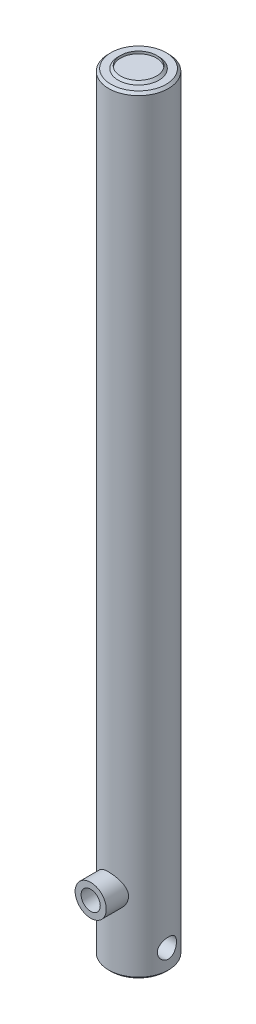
ISO-10303-21;
HEADER;
FILE_DESCRIPTION(('STEP AP214'),'2;1');
FILE_NAME('part.step','',(''),(''),'','','');
FILE_SCHEMA(('AUTOMOTIVE_DESIGN { 1 0 10303 214 1 1 1 1 }'));
ENDSEC;
DATA;
#1=APPLICATION_CONTEXT('core data for automotive mechanical design processes');
#2=APPLICATION_PROTOCOL_DEFINITION('international standard','automotive_design',2000,#1);
#3=PRODUCT_CONTEXT('',#1,'mechanical');
#4=PRODUCT('Part','Part','',(#3));
#5=PRODUCT_RELATED_PRODUCT_CATEGORY('part','',(#4));
#6=PRODUCT_DEFINITION_FORMATION('','',#4);
#7=PRODUCT_DEFINITION_CONTEXT('part definition',#1,'design');
#8=PRODUCT_DEFINITION('design','',#6,#7);
#9=PRODUCT_DEFINITION_SHAPE('','',#8);
#10=(LENGTH_UNIT() NAMED_UNIT(*) SI_UNIT(.MILLI.,.METRE.));
#11=(NAMED_UNIT(*) PLANE_ANGLE_UNIT() SI_UNIT($,.RADIAN.));
#12=(NAMED_UNIT(*) SI_UNIT($,.STERADIAN.) SOLID_ANGLE_UNIT());
#13=UNCERTAINTY_MEASURE_WITH_UNIT(LENGTH_MEASURE(1.E-05),#10,'distance_accuracy_value','');
#14=(GEOMETRIC_REPRESENTATION_CONTEXT(3) GLOBAL_UNCERTAINTY_ASSIGNED_CONTEXT((#13)) GLOBAL_UNIT_ASSIGNED_CONTEXT((#10,
#11,#12)) REPRESENTATION_CONTEXT('',''));
#15=CARTESIAN_POINT('',(0.,0.,0.));
#16=DIRECTION('',(0.,0.,1.));
#17=DIRECTION('',(1.,0.,0.));
#18=AXIS2_PLACEMENT_3D('',#15,#16,#17);
#19=CARTESIAN_POINT('',(0.,642.,0.));
#20=DIRECTION('',(0.,-1.,0.));
#21=DIRECTION('',(0.,0.,-1.));
#22=AXIS2_PLACEMENT_3D('',#19,#20,#21);
#23=CYLINDRICAL_SURFACE('',#22,25.);
#24=CARTESIAN_POINT('',(0.,640.,0.));
#25=DIRECTION('',(0.,1.,0.));
#26=DIRECTION('',(0.,0.,1.));
#27=AXIS2_PLACEMENT_3D('',#24,#25,#26);
#28=CIRCLE('',#27,25.);
#29=CARTESIAN_POINT('',(0.,640.,25.));
#30=VERTEX_POINT('',#29);
#31=EDGE_CURVE('E45',#30,#30,#28,.F.);
#32=ORIENTED_EDGE('',*,*,#31,.T.);
#33=EDGE_LOOP('',(#32));
#34=FACE_BOUND('',#33,.T.);
#35=CARTESIAN_POINT('',(0.,2.00000000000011,0.));
#36=DIRECTION('',(0.,1.,0.));
#37=DIRECTION('',(0.,0.,1.));
#38=AXIS2_PLACEMENT_3D('',#35,#36,#37);
#39=CIRCLE('',#38,25.);
#40=CARTESIAN_POINT('',(0.,2.00000000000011,25.));
#41=VERTEX_POINT('',#40);
#42=EDGE_CURVE('E50',#41,#41,#39,.T.);
#43=ORIENTED_EDGE('',*,*,#42,.T.);
#44=EDGE_LOOP('',(#43));
#45=FACE_BOUND('',#44,.T.);
#46=CARTESIAN_POINT('',(-25.,10.,0.));
#47=CARTESIAN_POINT('',(-24.9999999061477,10.0000001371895,-0.218743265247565));
#48=CARTESIAN_POINT('',(-24.9971224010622,10.0089788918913,-0.437488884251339));
#49=CARTESIAN_POINT('',(-24.985691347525,10.0448093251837,-0.873361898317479));
#50=CARTESIAN_POINT('',(-24.9771377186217,10.0716612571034,-1.09048927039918));
#51=CARTESIAN_POINT('',(-24.9545891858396,10.1429863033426,-1.52153070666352));
#52=CARTESIAN_POINT('',(-24.9405945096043,10.1874586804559,-1.73544490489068));
#53=CARTESIAN_POINT('',(-24.9075364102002,10.2936445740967,-2.15863313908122));
#54=CARTESIAN_POINT('',(-24.888471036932,10.3553647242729,-2.36790535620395));
#55=CARTESIAN_POINT('',(-24.8458260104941,10.4953678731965,-2.77988031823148));
#56=CARTESIAN_POINT('',(-24.8222555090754,10.5736173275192,-2.98259542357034));
#57=CARTESIAN_POINT('',(-24.7711822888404,10.746155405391,-3.3806527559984));
#58=CARTESIAN_POINT('',(-24.7436780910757,10.8404500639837,-3.57599217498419));
#59=CARTESIAN_POINT('',(-24.6854603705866,11.0443195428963,-3.95794908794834));
#60=CARTESIAN_POINT('',(-24.6547477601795,11.1538900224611,-4.1445690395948));
#61=CARTESIAN_POINT('',(-24.5908719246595,11.3876160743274,-4.50811504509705));
#62=CARTESIAN_POINT('',(-24.5577075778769,11.5117783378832,-4.68503659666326));
#63=CARTESIAN_POINT('',(-24.488796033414,11.7776146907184,-5.03301408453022));
#64=CARTESIAN_POINT('',(-24.4530019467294,11.9196903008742,-5.20375408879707));
#65=CARTESIAN_POINT('',(-24.3806687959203,12.2174517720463,-5.53275380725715));
#66=CARTESIAN_POINT('',(-24.3441297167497,12.3731379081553,-5.69101326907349));
#67=CARTESIAN_POINT('',(-24.2712721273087,12.697209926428,-5.99413557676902));
#68=CARTESIAN_POINT('',(-24.2349537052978,12.8656005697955,-6.13899335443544));
#69=CARTESIAN_POINT('',(-24.1635539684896,13.2139385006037,-6.41427135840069));
#70=CARTESIAN_POINT('',(-24.1284722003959,13.3938814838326,-6.54469691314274));
#71=CARTESIAN_POINT('',(-24.0596046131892,13.7692203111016,-6.79356627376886));
#72=CARTESIAN_POINT('',(-24.0258780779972,13.9648998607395,-6.91159914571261));
#73=CARTESIAN_POINT('',(-23.9617792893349,14.3659893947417,-7.13064926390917));
#74=CARTESIAN_POINT('',(-23.9314057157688,14.5713955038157,-7.23167321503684));
#75=CARTESIAN_POINT('',(-23.8749509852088,14.9906124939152,-7.4159292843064));
#76=CARTESIAN_POINT('',(-23.8488697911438,15.2044233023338,-7.4991615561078));
#77=CARTESIAN_POINT('',(-23.8018507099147,15.6389145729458,-7.64708668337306));
#78=CARTESIAN_POINT('',(-23.7809126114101,15.8595947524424,-7.71178030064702));
#79=CARTESIAN_POINT('',(-23.7454507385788,16.2991473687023,-7.82027654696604));
#80=CARTESIAN_POINT('',(-23.7307462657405,16.5178591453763,-7.86467114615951));
#81=CARTESIAN_POINT('',(-23.7073033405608,16.9585421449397,-7.93505826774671));
#82=CARTESIAN_POINT('',(-23.6985647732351,17.1805133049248,-7.96105114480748));
#83=CARTESIAN_POINT('',(-23.6873457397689,17.625956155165,-7.99437065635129));
#84=CARTESIAN_POINT('',(-23.6848637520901,17.8494274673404,-8.00170182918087));
#85=CARTESIAN_POINT('',(-23.6862371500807,18.2961770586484,-7.99763563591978));
#86=CARTESIAN_POINT('',(-23.690092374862,18.5194553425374,-7.98623874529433));
#87=CARTESIAN_POINT('',(-23.703717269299,18.9547488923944,-7.9457042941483));
#88=CARTESIAN_POINT('',(-23.7132321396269,19.1668438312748,-7.91733072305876));
#89=CARTESIAN_POINT('',(-23.7376725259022,19.5878528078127,-7.84374939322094));
#90=CARTESIAN_POINT('',(-23.7525999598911,19.7967656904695,-7.79853566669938));
#91=CARTESIAN_POINT('',(-23.7874147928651,20.2098541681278,-7.69168696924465));
#92=CARTESIAN_POINT('',(-23.8073007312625,20.4140311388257,-7.63005683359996));
#93=CARTESIAN_POINT('',(-23.8514666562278,20.8164668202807,-7.49085223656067));
#94=CARTESIAN_POINT('',(-23.8757483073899,21.0147232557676,-7.41327173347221));
#95=CARTESIAN_POINT('',(-23.9284057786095,21.4068930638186,-7.24151771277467));
#96=CARTESIAN_POINT('',(-23.9568367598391,21.6006990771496,-7.14711609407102));
#97=CARTESIAN_POINT('',(-24.016734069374,21.9797691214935,-6.94318205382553));
#98=CARTESIAN_POINT('',(-24.0482014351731,22.1650302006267,-6.83364445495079));
#99=CARTESIAN_POINT('',(-24.1133164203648,22.5258732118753,-6.60020078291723));
#100=CARTESIAN_POINT('',(-24.1469641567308,22.7014546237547,-6.47629393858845));
#101=CARTESIAN_POINT('',(-24.2155584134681,23.0419323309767,-6.21490027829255));
#102=CARTESIAN_POINT('',(-24.2505049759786,23.2068282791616,-6.07741302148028));
#103=CARTESIAN_POINT('',(-24.3224956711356,23.5326525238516,-5.78275806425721));
#104=CARTESIAN_POINT('',(-24.3595598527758,23.693008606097,-5.62496187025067));
#105=CARTESIAN_POINT('',(-24.433099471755,23.9998782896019,-5.29641148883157));
#106=CARTESIAN_POINT('',(-24.4695750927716,24.1463962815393,-5.12566144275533));
#107=CARTESIAN_POINT('',(-24.5409699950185,24.4247424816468,-4.77213983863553));
#108=CARTESIAN_POINT('',(-24.575888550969,24.5565638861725,-4.58936277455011));
#109=CARTESIAN_POINT('',(-24.6431823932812,24.804459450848,-4.21308321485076));
#110=CARTESIAN_POINT('',(-24.6755586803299,24.9205398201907,-4.01958499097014));
#111=CARTESIAN_POINT('',(-24.7371662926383,25.1371054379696,-3.62126665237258));
#112=CARTESIAN_POINT('',(-24.7663668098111,25.2374414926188,-3.41636056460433));
#113=CARTESIAN_POINT('',(-24.8204446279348,25.4203846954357,-2.99832036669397));
#114=CARTESIAN_POINT('',(-24.8453235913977,25.502998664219,-2.78518945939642));
#115=CARTESIAN_POINT('',(-24.8900514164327,25.6498072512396,-2.35217103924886));
#116=CARTESIAN_POINT('',(-24.9099005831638,25.7140029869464,-2.13228393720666));
#117=CARTESIAN_POINT('',(-24.9439857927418,25.823370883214,-1.68740364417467));
#118=CARTESIAN_POINT('',(-24.9582220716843,25.8685438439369,-1.46241066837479));
#119=CARTESIAN_POINT('',(-24.9802051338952,25.9379900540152,-1.01822864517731));
#120=CARTESIAN_POINT('',(-24.9881904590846,25.9630326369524,-0.799171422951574));
#121=CARTESIAN_POINT('',(-24.998380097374,25.9949508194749,-0.359605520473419));
#122=CARTESIAN_POINT('',(-25.0005845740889,26.0018269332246,-0.139096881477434));
#123=CARTESIAN_POINT('',(-24.9991510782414,25.9973469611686,0.301684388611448));
#124=CARTESIAN_POINT('',(-24.99551390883,25.9859933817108,0.521957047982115));
#125=CARTESIAN_POINT('',(-24.9825002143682,25.9451677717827,0.960643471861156));
#126=CARTESIAN_POINT('',(-24.9731237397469,25.9156959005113,1.17905725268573));
#127=CARTESIAN_POINT('',(-24.9492140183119,25.8399319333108,1.60666085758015));
#128=CARTESIAN_POINT('',(-24.934824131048,25.7941066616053,1.81594168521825));
#129=CARTESIAN_POINT('',(-24.9012216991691,25.6859277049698,2.22986305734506));
#130=CARTESIAN_POINT('',(-24.8820075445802,25.6235685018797,2.43450202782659));
#131=CARTESIAN_POINT('',(-24.8392571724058,25.4828594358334,2.83767351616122));
#132=CARTESIAN_POINT('',(-24.8157221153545,25.4045138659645,3.03620765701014));
#133=CARTESIAN_POINT('',(-24.7649102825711,25.232395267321,3.4260590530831));
#134=CARTESIAN_POINT('',(-24.737632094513,25.138616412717,3.61737354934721));
#135=CARTESIAN_POINT('',(-24.6793044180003,24.9338254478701,3.9961937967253));
#136=CARTESIAN_POINT('',(-24.6481783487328,24.8224445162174,4.18348835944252));
#137=CARTESIAN_POINT('',(-24.5835041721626,24.5849625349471,4.54814586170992));
#138=CARTESIAN_POINT('',(-24.5499552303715,24.4588564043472,4.72550534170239));
#139=CARTESIAN_POINT('',(-24.4812982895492,24.1927767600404,5.0691961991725));
#140=CARTESIAN_POINT('',(-24.446190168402,24.0528021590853,5.23552671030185));
#141=CARTESIAN_POINT('',(-24.3753123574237,23.7598651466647,5.55617802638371));
#142=CARTESIAN_POINT('',(-24.3395426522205,23.6069024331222,5.71049855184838));
#143=CARTESIAN_POINT('',(-24.2667654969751,23.2822313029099,6.01242126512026));
#144=CARTESIAN_POINT('',(-24.2297690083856,23.1100058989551,6.15947074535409));
#145=CARTESIAN_POINT('',(-24.1571160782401,22.7535963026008,6.43851923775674));
#146=CARTESIAN_POINT('',(-24.1214591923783,22.5694161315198,6.57052327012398));
#147=CARTESIAN_POINT('',(-24.0524927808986,22.1901300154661,6.818664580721));
#148=CARTESIAN_POINT('',(-24.0191842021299,21.9950197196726,6.93479547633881));
#149=CARTESIAN_POINT('',(-23.9559420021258,21.5952855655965,7.15020596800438));
#150=CARTESIAN_POINT('',(-23.9260069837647,21.390665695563,7.24949254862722));
#151=CARTESIAN_POINT('',(-23.870505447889,20.9738139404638,7.43020088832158));
#152=CARTESIAN_POINT('',(-23.8449266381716,20.7616055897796,7.51167310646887));
#153=CARTESIAN_POINT('',(-23.7988621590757,20.3306052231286,7.65636529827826));
#154=CARTESIAN_POINT('',(-23.7783744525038,20.1118158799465,7.71959257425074));
#155=CARTESIAN_POINT('',(-23.7431606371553,19.6692285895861,7.82723033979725));
#156=CARTESIAN_POINT('',(-23.7284337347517,19.4454313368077,7.87164342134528));
#157=CARTESIAN_POINT('',(-23.7052408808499,18.9945456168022,7.94121566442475));
#158=CARTESIAN_POINT('',(-23.6967746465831,18.7674572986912,7.96637569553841));
#159=CARTESIAN_POINT('',(-23.6866420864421,18.3226330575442,7.99645049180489));
#160=CARTESIAN_POINT('',(-23.6846721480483,18.1049646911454,8.00226930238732));
#161=CARTESIAN_POINT('',(-23.6867399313,17.6699078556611,7.99614679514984));
#162=CARTESIAN_POINT('',(-23.6907775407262,17.4525193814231,7.98420580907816));
#163=CARTESIAN_POINT('',(-23.7047316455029,17.0196419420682,7.94268054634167));
#164=CARTESIAN_POINT('',(-23.7146477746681,16.8041528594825,7.91309736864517));
#165=CARTESIAN_POINT('',(-23.7400470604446,16.3766164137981,7.83656732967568));
#166=CARTESIAN_POINT('',(-23.7555302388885,16.1645690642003,7.78962040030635));
#167=CARTESIAN_POINT('',(-23.7912922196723,15.7488263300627,7.67969358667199));
#168=CARTESIAN_POINT('',(-23.8114885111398,15.5450510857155,7.61698826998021));
#169=CARTESIAN_POINT('',(-23.8562299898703,15.1435096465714,7.47567925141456));
#170=CARTESIAN_POINT('',(-23.8807766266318,14.9457454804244,7.39707024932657));
#171=CARTESIAN_POINT('',(-23.933522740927,14.5575458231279,7.22458410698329));
#172=CARTESIAN_POINT('',(-23.961721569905,14.3671090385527,7.13070967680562));
#173=CARTESIAN_POINT('',(-24.0210238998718,13.9945755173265,6.92831365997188));
#174=CARTESIAN_POINT('',(-24.0521284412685,13.8124818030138,6.81978682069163));
#175=CARTESIAN_POINT('',(-24.1177267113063,13.4505281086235,6.5841334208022));
#176=CARTESIAN_POINT('',(-24.1523067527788,13.2710586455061,6.45643079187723));
#177=CARTESIAN_POINT('',(-24.2227744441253,12.923408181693,6.18680926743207));
#178=CARTESIAN_POINT('',(-24.2586621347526,12.7552275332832,6.0448899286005));
#179=CARTESIAN_POINT('',(-24.3307982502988,12.4310931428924,5.74766448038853));
#180=CARTESIAN_POINT('',(-24.3670468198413,12.2751445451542,5.592352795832));
#181=CARTESIAN_POINT('',(-24.4389215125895,11.9765557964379,5.26938993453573));
#182=CARTESIAN_POINT('',(-24.4745478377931,11.8339112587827,5.10174285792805));
#183=CARTESIAN_POINT('',(-24.5454895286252,11.5579927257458,4.74894112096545));
#184=CARTESIAN_POINT('',(-24.5807495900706,11.4252268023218,4.56337747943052));
#185=CARTESIAN_POINT('',(-24.6486157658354,11.1758772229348,4.18131157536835));
#186=CARTESIAN_POINT('',(-24.6812228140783,11.0592878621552,3.98481320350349));
#187=CARTESIAN_POINT('',(-24.7428727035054,10.8431514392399,3.58214010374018));
#188=CARTESIAN_POINT('',(-24.7719158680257,10.7436028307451,3.37596625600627));
#189=CARTESIAN_POINT('',(-24.8256070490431,10.5623752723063,2.95536223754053));
#190=CARTESIAN_POINT('',(-24.8502553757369,10.4806950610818,2.74093265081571));
#191=CARTESIAN_POINT('',(-24.8928821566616,10.3410390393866,2.32073755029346));
#192=CARTESIAN_POINT('',(-24.9112083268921,10.2817980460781,2.11542697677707));
#193=CARTESIAN_POINT('',(-24.942975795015,10.1798727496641,1.70037248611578));
#194=CARTESIAN_POINT('',(-24.9564174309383,10.1371873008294,1.49062887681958));
#195=CARTESIAN_POINT('',(-24.9780652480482,10.0687454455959,1.06816763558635));
#196=CARTESIAN_POINT('',(-24.9862723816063,10.042985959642,0.855450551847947));
#197=CARTESIAN_POINT('',(-24.9972398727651,10.0086129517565,0.428489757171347));
#198=CARTESIAN_POINT('',(-25.0000000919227,9.99999986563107,0.214246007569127));
#199=CARTESIAN_POINT('',(-25.,10.,0.));
#200=B_SPLINE_CURVE_WITH_KNOTS('',3,(#46,#47,#48,#49,#50,#51,#52,#53,#54,#55,#56,#57,#58,#59,
#60,#61,#62,#63,#64,#65,#66,#67,#68,#69,#70,#71,#72,#73,#74,#75,#76,#77,#78,#79,#80,#81,#82,#83,
#84,#85,#86,#87,#88,#89,#90,#91,#92,#93,#94,#95,#96,#97,#98,#99,#100,#101,#102,#103,#104,#105,
#106,#107,#108,#109,#110,#111,#112,#113,#114,#115,#116,#117,#118,#119,#120,#121,#122,#123,#124,
#125,#126,#127,#128,#129,#130,#131,#132,#133,#134,#135,#136,#137,#138,#139,#140,#141,#142,#143,
#144,#145,#146,#147,#148,#149,#150,#151,#152,#153,#154,#155,#156,#157,#158,#159,#160,#161,#162,
#163,#164,#165,#166,#167,#168,#169,#170,#171,#172,#173,#174,#175,#176,#177,#178,#179,#180,#181,
#182,#183,#184,#185,#186,#187,#188,#189,#190,#191,#192,#193,#194,#195,#196,#197,#198,#199),
.UNSPECIFIED.,.T.,.F.,(4,2,2,2,2,2,2,2,2,2,2,2,2,2,2,2,2,2,2,2,2,2,2,2,2,2,2,2,2,2,2,2,2,2,2,2,
2,2,2,2,2,2,2,2,2,2,2,2,2,2,2,2,2,2,2,2,2,2,2,2,2,2,2,2,2,2,2,2,2,2,2,2,2,2,2,2,4),(0.,
0.656031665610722,1.3120726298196,1.96808614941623,2.62435232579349,3.27929926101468,
3.93449308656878,4.58950111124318,5.24481067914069,5.91900362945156,6.59321020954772,
7.26767072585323,7.9418813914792,8.63402376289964,9.32589265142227,10.0177555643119,
10.7095900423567,11.3797100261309,12.0498170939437,12.7197611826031,13.3896882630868,
14.0315222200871,14.673583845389,15.3154565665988,15.9575728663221,16.6091708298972,
17.2609922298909,17.9128486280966,18.5647261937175,19.2479546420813,19.9309655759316,
20.6142914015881,21.2973468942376,21.9865280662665,22.6754435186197,23.3643171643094,
24.0531618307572,24.7142284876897,25.375276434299,26.0362335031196,26.6971847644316,
27.3406067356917,27.9842437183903,28.6277080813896,29.2714159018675,29.9310423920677,
30.5908971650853,31.2508037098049,31.9107256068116,32.5983077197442,33.2856597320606,
33.9732873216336,34.6606290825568,35.3459979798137,36.0310921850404,36.7160919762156,
37.4010608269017,38.0535257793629,38.7059785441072,39.3583906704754,40.0108053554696,
40.6525575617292,41.2945239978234,41.9363765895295,42.5784598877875,43.2465993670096,
43.9147596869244,44.5831995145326,45.2514181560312,45.9432092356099,46.6347557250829,
47.3262394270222,48.0176743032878,48.660363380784,49.3030079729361,49.9455356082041,
50.588079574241),.UNSPECIFIED.);
#201=CARTESIAN_POINT('',(-25.,10.,0.));
#202=VERTEX_POINT('',#201);
#203=EDGE_CURVE('E56',#202,#202,#200,.T.);
#204=ORIENTED_EDGE('',*,*,#203,.T.);
#205=EDGE_LOOP('',(#204));
#206=FACE_BOUND('',#205,.T.);
#207=CARTESIAN_POINT('',(23.685438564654,18.,-8.));
#208=CARTESIAN_POINT('',(23.6854386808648,17.7815803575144,-7.99999984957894));
#209=CARTESIAN_POINT('',(23.6884680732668,17.5631583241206,-7.99104739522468));
#210=CARTESIAN_POINT('',(23.7004886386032,17.1279420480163,-7.95532466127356));
#211=CARTESIAN_POINT('',(23.7094799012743,16.911147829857,-7.92855411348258));
#212=CARTESIAN_POINT('',(23.7331386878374,16.4807765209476,-7.85745049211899));
#213=CARTESIAN_POINT('',(23.7478062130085,16.2671994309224,-7.81311741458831));
#214=CARTESIAN_POINT('',(23.7823668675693,15.8446965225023,-7.70727713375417));
#215=CARTESIAN_POINT('',(23.8022620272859,15.6357725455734,-7.64576325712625));
#216=CARTESIAN_POINT('',(23.8466255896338,15.2245298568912,-7.50625010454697));
#217=CARTESIAN_POINT('',(23.8710835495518,15.02219727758,-7.42828841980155));
#218=CARTESIAN_POINT('',(23.9238870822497,14.6249122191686,-7.25642411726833));
#219=CARTESIAN_POINT('',(23.9522341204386,14.4299625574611,-7.16251548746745));
#220=CARTESIAN_POINT('',(24.0419138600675,13.8581469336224,-6.85793629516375));
#221=CARTESIAN_POINT('',(24.1079252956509,13.493962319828,-6.62429224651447));
#222=CARTESIAN_POINT('',(24.2476140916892,12.7973644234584,-6.09348517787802));
#223=CARTESIAN_POINT('',(24.3214714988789,12.466378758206,-5.7944955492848));
#224=CARTESIAN_POINT('',(24.4305604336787,12.010501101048,-5.30805806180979));
#225=CARTESIAN_POINT('',(24.4666614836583,11.8652345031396,-5.13947531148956));
#226=CARTESIAN_POINT('',(24.5373497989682,11.5891239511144,-4.79062429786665));
#227=CARTESIAN_POINT('',(24.5719376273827,11.4582746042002,-4.61036044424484));
#228=CARTESIAN_POINT('',(24.6394882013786,11.2088922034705,-4.2347279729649));
#229=CARTESIAN_POINT('',(24.6723910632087,11.0907355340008,-4.03909881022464));
#230=CARTESIAN_POINT('',(24.7347020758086,10.8714280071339,-3.63808475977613));
#231=CARTESIAN_POINT('',(24.7641115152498,10.7702708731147,-3.43270350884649));
#232=CARTESIAN_POINT('',(24.8186071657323,10.5857545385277,-3.01353634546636));
#233=CARTESIAN_POINT('',(24.8436933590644,10.5023954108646,-2.79975039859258));
#234=CARTESIAN_POINT('',(24.8888108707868,10.3542239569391,-2.36532685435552));
#235=CARTESIAN_POINT('',(24.9088423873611,10.2894109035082,-2.14468952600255));
#236=CARTESIAN_POINT('',(24.9427027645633,10.180728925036,-1.70544007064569));
#237=CARTESIAN_POINT('',(24.956710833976,10.1362519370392,-1.48699212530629));
#238=CARTESIAN_POINT('',(24.9790435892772,10.0656605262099,-1.04686465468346));
#239=CARTESIAN_POINT('',(24.9873684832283,10.0395454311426,-0.825185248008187));
#240=CARTESIAN_POINT('',(24.9980969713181,10.0059330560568,-0.380320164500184));
#241=CARTESIAN_POINT('',(25.0005017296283,9.99843211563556,-0.15713479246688));
#242=CARTESIAN_POINT('',(24.9993242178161,10.0021118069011,0.289063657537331));
#243=CARTESIAN_POINT('',(24.9957420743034,10.0132920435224,0.512076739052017));
#244=CARTESIAN_POINT('',(24.9829322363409,10.0534758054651,0.948121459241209));
#245=CARTESIAN_POINT('',(24.9739148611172,10.0818155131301,1.16122085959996));
#246=CARTESIAN_POINT('',(24.9506525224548,10.1554934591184,1.5842429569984));
#247=CARTESIAN_POINT('',(24.9364058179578,10.2008373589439,1.79416457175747));
#248=CARTESIAN_POINT('',(24.9030628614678,10.3081123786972,2.20925418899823));
#249=CARTESIAN_POINT('',(24.8839681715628,10.3700381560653,2.41442369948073));
#250=CARTESIAN_POINT('',(24.8414105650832,10.5099985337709,2.81880756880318));
#251=CARTESIAN_POINT('',(24.8179460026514,10.588039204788,3.01801965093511));
#252=CARTESIAN_POINT('',(24.7669381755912,10.7606557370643,3.41154230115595));
#253=CARTESIAN_POINT('',(24.7393486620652,10.8554216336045,3.6057634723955));
#254=CARTESIAN_POINT('',(24.681002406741,11.0601508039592,3.98560664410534));
#255=CARTESIAN_POINT('',(24.6502445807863,11.170119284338,4.17122566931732));
#256=CARTESIAN_POINT('',(24.5863436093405,11.4044713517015,4.5327035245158));
#257=CARTESIAN_POINT('',(24.5532003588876,11.5288555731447,4.70856192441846));
#258=CARTESIAN_POINT('',(24.4853581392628,11.7912304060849,5.04950040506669));
#259=CARTESIAN_POINT('',(24.4506591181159,11.9292214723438,5.21458012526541));
#260=CARTESIAN_POINT('',(24.3790361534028,12.224294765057,5.53999615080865));
#261=CARTESIAN_POINT('',(24.3420813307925,12.3819484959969,5.69980789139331));
#262=CARTESIAN_POINT('',(24.2684460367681,12.7101016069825,6.00560235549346));
#263=CARTESIAN_POINT('',(24.2317654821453,12.8805969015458,6.15158944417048));
#264=CARTESIAN_POINT('',(24.1596686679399,13.233509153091,6.42891535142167));
#265=CARTESIAN_POINT('',(24.1242530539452,13.415932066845,6.56024676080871));
#266=CARTESIAN_POINT('',(24.055729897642,13.7914143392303,6.80722281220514));
#267=CARTESIAN_POINT('',(24.0226214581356,13.9844695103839,6.92287356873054));
#268=CARTESIAN_POINT('',(23.9592714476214,14.3825721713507,7.13905927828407));
#269=CARTESIAN_POINT('',(23.9290716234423,14.5877408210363,7.23938361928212));
#270=CARTESIAN_POINT('',(23.8729789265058,15.0063215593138,7.42226578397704));
#271=CARTESIAN_POINT('',(23.8470842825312,15.2197302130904,7.50483091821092));
#272=CARTESIAN_POINT('',(23.800429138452,15.6533276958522,7.6515032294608));
#273=CARTESIAN_POINT('',(23.7796681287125,15.8735158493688,7.71561223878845));
#274=CARTESIAN_POINT('',(23.743975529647,16.3190300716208,7.82476399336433));
#275=CARTESIAN_POINT('',(23.7290436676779,16.5443558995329,7.86980763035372));
#276=CARTESIAN_POINT('',(23.7060174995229,16.9888409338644,7.9388917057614));
#277=CARTESIAN_POINT('',(23.697662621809,17.2078622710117,7.963734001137));
#278=CARTESIAN_POINT('',(23.6870451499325,17.6473536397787,7.99525936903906));
#279=CARTESIAN_POINT('',(23.6847823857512,17.8678236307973,8.00194294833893));
#280=CARTESIAN_POINT('',(23.6864229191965,18.3085057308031,7.99708539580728));
#281=CARTESIAN_POINT('',(23.6903253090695,18.5287178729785,7.98554694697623));
#282=CARTESIAN_POINT('',(23.7041671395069,18.9672481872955,7.94436471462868));
#283=CARTESIAN_POINT('',(23.7141065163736,19.1855663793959,7.91472112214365));
#284=CARTESIAN_POINT('',(23.7393032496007,19.6119579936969,7.83881510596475));
#285=CARTESIAN_POINT('',(23.7543859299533,19.8201390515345,7.7930971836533));
#286=CARTESIAN_POINT('',(23.7894762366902,20.2318764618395,7.68531262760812));
#287=CARTESIAN_POINT('',(23.8094856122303,20.4354311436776,7.62324018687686));
#288=CARTESIAN_POINT('',(23.8538445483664,20.8364795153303,7.48328019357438));
#289=CARTESIAN_POINT('',(23.878193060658,21.0339746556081,7.40539646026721));
#290=CARTESIAN_POINT('',(23.9305644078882,21.4218204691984,7.23436820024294));
#291=CARTESIAN_POINT('',(23.9585886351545,21.612168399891,7.14121788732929));
#292=CARTESIAN_POINT('',(24.0184175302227,21.9900122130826,6.93737893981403));
#293=CARTESIAN_POINT('',(24.0503091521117,22.1772595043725,6.82625501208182));
#294=CARTESIAN_POINT('',(24.1163102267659,22.541870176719,6.58928737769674));
#295=CARTESIAN_POINT('',(24.1504204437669,22.719230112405,6.46343858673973));
#296=CARTESIAN_POINT('',(24.219938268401,23.0629783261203,6.19785668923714));
#297=CARTESIAN_POINT('',(24.2553459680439,23.2293658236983,6.05812259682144));
#298=CARTESIAN_POINT('',(24.3265313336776,23.5501889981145,5.76563306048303));
#299=CARTESIAN_POINT('',(24.3623090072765,23.7046244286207,5.6128773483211));
#300=CARTESIAN_POINT('',(24.4348785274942,24.0071453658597,5.28824824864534));
#301=CARTESIAN_POINT('',(24.4716456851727,24.1546520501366,5.11582929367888));
#302=CARTESIAN_POINT('',(24.5435459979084,24.4345900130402,4.75893573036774));
#303=CARTESIAN_POINT('',(24.5786796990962,24.5670263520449,4.57446520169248));
#304=CARTESIAN_POINT('',(24.646363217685,24.8159796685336,4.19452275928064));
#305=CARTESIAN_POINT('',(24.6789120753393,24.9324907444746,3.99904680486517));
#306=CARTESIAN_POINT('',(24.7404858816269,25.1485921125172,3.59852554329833));
#307=CARTESIAN_POINT('',(24.7695122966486,25.2481894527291,3.39348426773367));
#308=CARTESIAN_POINT('',(24.8230510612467,25.4290834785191,2.97657551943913));
#309=CARTESIAN_POINT('',(24.8475925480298,25.5104991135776,2.76476344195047));
#310=CARTESIAN_POINT('',(24.8916927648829,25.6551364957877,2.33459892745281));
#311=CARTESIAN_POINT('',(24.9112534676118,25.7183654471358,2.1162491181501));
#312=CARTESIAN_POINT('',(24.9448363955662,25.8260771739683,1.67456921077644));
#313=CARTESIAN_POINT('',(24.9588590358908,25.8705613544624,1.45123948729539));
#314=CARTESIAN_POINT('',(24.9809545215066,25.9403519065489,1.00131466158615));
#315=CARTESIAN_POINT('',(24.9890275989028,25.9656590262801,0.774719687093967));
#316=CARTESIAN_POINT('',(24.9987683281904,25.9961623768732,0.329977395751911));
#317=CARTESIAN_POINT('',(25.0006997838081,26.0021869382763,0.111892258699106));
#318=CARTESIAN_POINT('',(24.9988502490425,25.9964068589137,-0.324016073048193));
#319=CARTESIAN_POINT('',(24.9950693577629,25.9846025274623,-0.541839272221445));
#320=CARTESIAN_POINT('',(24.9818989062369,25.9432773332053,-0.975606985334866));
#321=CARTESIAN_POINT('',(24.9725097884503,25.9137578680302,-1.19155164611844));
#322=CARTESIAN_POINT('',(24.9483780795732,25.8372752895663,-1.62002344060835));
#323=CARTESIAN_POINT('',(24.9336354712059,25.7903121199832,-1.83255056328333));
#324=CARTESIAN_POINT('',(24.8994319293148,25.6801308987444,-2.24977742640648));
#325=CARTESIAN_POINT('',(24.8800393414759,25.6171475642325,-2.45454487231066));
#326=CARTESIAN_POINT('',(24.8369245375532,25.475118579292,-2.85803478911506));
#327=CARTESIAN_POINT('',(24.8132008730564,25.3960675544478,-3.056755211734));
#328=CARTESIAN_POINT('',(24.7620297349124,25.2225332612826,-3.44682151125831));
#329=CARTESIAN_POINT('',(24.7345824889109,25.1280509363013,-3.63816783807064));
#330=CARTESIAN_POINT('',(24.6766448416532,24.9243291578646,-4.01236245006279));
#331=CARTESIAN_POINT('',(24.6461542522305,24.8150887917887,-4.19521020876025));
#332=CARTESIAN_POINT('',(24.5817710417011,24.5785157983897,-4.55758428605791));
#333=CARTESIAN_POINT('',(24.5477966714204,24.4506835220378,-4.73676999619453));
#334=CARTESIAN_POINT('',(24.4782780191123,24.1808642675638,-5.08382063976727));
#335=CARTESIAN_POINT('',(24.4427337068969,24.0388770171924,-5.25168535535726));
#336=CARTESIAN_POINT('',(24.3709920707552,23.7416078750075,-5.5751413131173));
#337=CARTESIAN_POINT('',(24.3347945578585,23.5863220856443,-5.73072893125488));
#338=CARTESIAN_POINT('',(24.2627094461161,23.263442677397,-6.02863349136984));
#339=CARTESIAN_POINT('',(24.2268218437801,23.0958491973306,-6.17095058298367));
#340=CARTESIAN_POINT('',(24.1550622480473,22.7431926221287,-6.44623280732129));
#341=CARTESIAN_POINT('',(24.1192360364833,22.5577205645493,-6.57868658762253));
#342=CARTESIAN_POINT('',(24.0500083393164,22.1758986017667,-6.82742754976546));
#343=CARTESIAN_POINT('',(24.0166060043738,21.9795525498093,-6.94372040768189));
#344=CARTESIAN_POINT('',(23.9532271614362,21.5772254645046,-7.15929721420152));
#345=CARTESIAN_POINT('',(23.9232503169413,21.3712453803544,-7.25858283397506));
#346=CARTESIAN_POINT('',(23.8676625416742,20.9510447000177,-7.43933021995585));
#347=CARTESIAN_POINT('',(23.8420512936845,20.736824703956,-7.52079328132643));
#348=CARTESIAN_POINT('',(23.7976656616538,20.3171705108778,-7.66003007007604));
#349=CARTESIAN_POINT('',(23.7785344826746,20.1121956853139,-7.71907691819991));
#350=CARTESIAN_POINT('',(23.7453132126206,19.6978042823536,-7.82067534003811));
#351=CARTESIAN_POINT('',(23.7312227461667,19.4883880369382,-7.86322814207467));
#352=CARTESIAN_POINT('',(23.7085058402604,19.0665773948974,-7.93145930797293));
#353=CARTESIAN_POINT('',(23.6998781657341,18.8541836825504,-7.95714148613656));
#354=CARTESIAN_POINT('',(23.6883444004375,18.4278607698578,-7.99141211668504));
#355=CARTESIAN_POINT('',(23.6854384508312,18.2139315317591,-8.00000014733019));
#356=CARTESIAN_POINT('',(23.685438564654,18.,-8.));
#357=B_SPLINE_CURVE_WITH_KNOTS('',3,(#207,#208,#209,#210,#211,#212,#213,#214,#215,#216,#217,
#218,#219,#220,#221,#222,#223,#224,#225,#226,#227,#228,#229,#230,#231,#232,#233,#234,#235,#236,
#237,#238,#239,#240,#241,#242,#243,#244,#245,#246,#247,#248,#249,#250,#251,#252,#253,#254,#255,
#256,#257,#258,#259,#260,#261,#262,#263,#264,#265,#266,#267,#268,#269,#270,#271,#272,#273,#274,
#275,#276,#277,#278,#279,#280,#281,#282,#283,#284,#285,#286,#287,#288,#289,#290,#291,#292,#293,
#294,#295,#296,#297,#298,#299,#300,#301,#302,#303,#304,#305,#306,#307,#308,#309,#310,#311,#312,
#313,#314,#315,#316,#317,#318,#319,#320,#321,#322,#323,#324,#325,#326,#327,#328,#329,#330,#331,
#332,#333,#334,#335,#336,#337,#338,#339,#340,#341,#342,#343,#344,#345,#346,#347,#348,#349,#350,
#351,#352,#353,#354,#355,#356),.UNSPECIFIED.,.T.,.F.,(4,2,2,2,2,2,2,2,2,2,2,2,2,2,2,2,2,2,2,2,2,
2,2,2,2,2,2,2,2,2,2,2,2,2,2,2,2,2,2,2,2,2,2,2,2,2,2,2,2,2,2,2,2,2,2,2,2,2,2,2,2,2,2,2,2,2,2,2,2,
2,2,2,2,2,4),(0.,0.655059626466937,1.31012911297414,1.96519874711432,2.62052317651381,
3.27436579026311,3.92845545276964,5.23552596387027,6.585320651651,7.26102103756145,
7.93646781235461,8.6283219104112,9.31991999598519,10.0115209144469,10.7030947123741,
11.3723642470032,12.0416092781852,12.7107226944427,13.379821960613,14.0245575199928,
14.6695079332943,15.3142507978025,15.9592369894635,16.6120885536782,17.2651642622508,
17.9182687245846,18.5713950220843,19.253131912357,19.9346528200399,20.6165167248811,
21.2981139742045,21.9883670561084,22.6783354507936,23.3682353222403,24.0581029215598,
24.7190289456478,25.379936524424,26.0407468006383,26.7015501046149,27.3418387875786,
27.9823551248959,28.6227169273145,29.2633219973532,29.9227705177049,30.5824474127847,
31.2421711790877,31.9019085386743,32.5906888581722,33.279237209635,33.9680400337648,
34.6565551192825,35.3404244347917,36.0240224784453,36.7075692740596,37.391089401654,
38.0448231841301,38.6985456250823,39.3522164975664,40.0058894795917,40.6504875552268,
41.2953015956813,41.9400762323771,42.5848907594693,43.2522885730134,43.9196992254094,
44.5873061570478,45.254905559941,45.9462048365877,46.6372606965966,47.3282486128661,
48.0191862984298,48.6609628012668,49.3026915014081,49.9442750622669,50.5858744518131),.UNSPECIFIED.);
#358=CARTESIAN_POINT('',(23.685438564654,18.,-8.));
#359=VERTEX_POINT('',#358);
#360=EDGE_CURVE('E62',#359,#359,#357,.T.);
#361=ORIENTED_EDGE('',*,*,#360,.T.);
#362=EDGE_LOOP('',(#361));
#363=FACE_BOUND('',#362,.T.);
#364=CARTESIAN_POINT('',(-13.,60.,21.3541565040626));
#365=CARTESIAN_POINT('',(-12.9999999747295,59.6632984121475,21.3541566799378));
#366=CARTESIAN_POINT('',(-12.9869023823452,59.3265934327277,21.3621466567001));
#367=CARTESIAN_POINT('',(-12.9346976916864,58.6558214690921,21.3937962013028));
#368=CARTESIAN_POINT('',(-12.8955798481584,58.3217556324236,21.4174622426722));
#369=CARTESIAN_POINT('',(-12.7917965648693,57.6584566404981,21.4796086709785));
#370=CARTESIAN_POINT('',(-12.7270883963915,57.3292325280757,21.5181138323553));
#371=CARTESIAN_POINT('',(-12.5729776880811,56.6785511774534,21.6085212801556));
#372=CARTESIAN_POINT('',(-12.483577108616,56.3570933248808,21.6604225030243));
#373=CARTESIAN_POINT('',(-12.2816998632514,55.7257695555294,21.7755194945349));
#374=CARTESIAN_POINT('',(-12.1693624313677,55.4158464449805,21.8386468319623));
#375=CARTESIAN_POINT('',(-11.9223217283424,54.8071011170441,21.9744876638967));
#376=CARTESIAN_POINT('',(-11.7876097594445,54.5082832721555,22.0472048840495));
#377=CARTESIAN_POINT('',(-11.4969559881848,53.9232683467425,22.200156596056));
#378=CARTESIAN_POINT('',(-11.3410187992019,53.6370685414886,22.2803894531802));
#379=CARTESIAN_POINT('',(-11.0089056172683,53.0783208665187,22.4463461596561));
#380=CARTESIAN_POINT('',(-10.8327278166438,52.8057742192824,22.532070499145));
#381=CARTESIAN_POINT('',(-10.4443891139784,52.2514970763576,22.7148590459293));
#382=CARTESIAN_POINT('',(-10.2304174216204,51.9711416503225,22.8122500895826));
#383=CARTESIAN_POINT('',(-9.78082288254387,51.4291516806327,23.0085995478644));
#384=CARTESIAN_POINT('',(-9.54520768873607,51.167510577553,23.1075573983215));
#385=CARTESIAN_POINT('',(-9.05314639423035,50.6638013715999,23.3047386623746));
#386=CARTESIAN_POINT('',(-8.7966817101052,50.4217511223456,23.4029613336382));
#387=CARTESIAN_POINT('',(-8.26434408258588,49.9588350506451,23.5962024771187));
#388=CARTESIAN_POINT('',(-7.98847815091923,49.7379616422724,23.6912220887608));
#389=CARTESIAN_POINT('',(-7.39714155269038,49.3029495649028,23.8827540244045));
#390=CARTESIAN_POINT('',(-7.08025187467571,49.0905490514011,23.9788468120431));
#391=CARTESIAN_POINT('',(-6.42708350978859,48.6934231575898,24.1621117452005));
#392=CARTESIAN_POINT('',(-6.09080359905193,48.5086995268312,24.2492833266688));
#393=CARTESIAN_POINT('',(-5.40113184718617,48.1688773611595,24.4121533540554));
#394=CARTESIAN_POINT('',(-5.04774906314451,48.0137633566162,24.4878577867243));
#395=CARTESIAN_POINT('',(-4.32624848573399,47.7348826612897,24.6255636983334));
#396=CARTESIAN_POINT('',(-3.95813241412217,47.6111123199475,24.687566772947));
#397=CARTESIAN_POINT('',(-3.23856120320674,47.4047232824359,24.7918069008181));
#398=CARTESIAN_POINT('',(-2.88796237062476,47.3196940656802,24.8351870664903));
#399=CARTESIAN_POINT('',(-2.17944952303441,47.1789072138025,24.9073634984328));
#400=CARTESIAN_POINT('',(-1.82153584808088,47.1231482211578,24.9361604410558));
#401=CARTESIAN_POINT('',(-1.10159986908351,47.0416959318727,24.97831919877));
#402=CARTESIAN_POINT('',(-0.739579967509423,47.0159858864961,24.9916896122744));
#403=CARTESIAN_POINT('',(-0.0144297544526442,46.9949496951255,25.0026247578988));
#404=CARTESIAN_POINT('',(0.34870047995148,46.9996214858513,25.0001905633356));
#405=CARTESIAN_POINT('',(1.03877012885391,47.0374033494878,24.9805664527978));
#406=CARTESIAN_POINT('',(1.36590265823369,47.0677987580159,24.9647851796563));
#407=CARTESIAN_POINT('',(2.01607833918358,47.1530972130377,24.9207057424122));
#408=CARTESIAN_POINT('',(2.33912180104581,47.207998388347,24.8924085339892));
#409=CARTESIAN_POINT('',(2.97894364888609,47.3416935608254,24.8239688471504));
#410=CARTESIAN_POINT('',(3.29572182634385,47.4204883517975,24.7838259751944));
#411=CARTESIAN_POINT('',(3.92101505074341,47.6011468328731,24.6926200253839));
#412=CARTESIAN_POINT('',(4.22952978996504,47.7030113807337,24.6415565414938));
#413=CARTESIAN_POINT('',(4.84038556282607,47.9302766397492,24.5289290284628));
#414=CARTESIAN_POINT('',(5.14259780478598,48.0559607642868,24.46723946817));
#415=CARTESIAN_POINT('',(5.73512775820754,48.3288939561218,24.3351691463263));
#416=CARTESIAN_POINT('',(6.02544549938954,48.4761429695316,24.2647884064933));
#417=CARTESIAN_POINT('',(6.59285562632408,48.7910948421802,24.1168039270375));
#418=CARTESIAN_POINT('',(6.86994699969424,48.9587992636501,24.0391996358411));
#419=CARTESIAN_POINT('',(7.40982128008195,49.3136095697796,23.8783150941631));
#420=CARTESIAN_POINT('',(7.67259856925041,49.5007229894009,23.7950326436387));
#421=CARTESIAN_POINT('',(8.20821657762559,49.9128556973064,23.6159410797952));
#422=CARTESIAN_POINT('',(8.47944170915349,50.1397943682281,23.5197115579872));
#423=CARTESIAN_POINT('',(9.00203897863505,50.6144831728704,23.3246886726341));
#424=CARTESIAN_POINT('',(9.25340985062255,50.8622346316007,23.2258951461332));
#425=CARTESIAN_POINT('',(9.73534374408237,51.377494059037,23.0280477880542));
#426=CARTESIAN_POINT('',(9.96589107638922,51.6450166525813,22.9289938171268));
#427=CARTESIAN_POINT('',(10.4048709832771,52.1984969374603,22.7331573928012));
#428=CARTESIAN_POINT('',(10.6132994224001,52.4844580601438,22.6363753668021));
#429=CARTESIAN_POINT('',(11.0212040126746,53.0951075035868,22.4407642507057));
#430=CARTESIAN_POINT('',(11.2189121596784,53.421098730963,22.342302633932));
#431=CARTESIAN_POINT('',(11.5857681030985,54.0910448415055,22.1542877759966));
#432=CARTESIAN_POINT('',(11.7549289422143,54.4349914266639,22.0647304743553));
#433=CARTESIAN_POINT('',(12.0630062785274,55.1387934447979,21.8978213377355));
#434=CARTESIAN_POINT('',(12.2019417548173,55.4986387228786,21.82046185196));
#435=CARTESIAN_POINT('',(12.4479414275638,56.231944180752,21.6810698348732));
#436=CARTESIAN_POINT('',(12.5550103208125,56.6054023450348,21.6190350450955));
#437=CARTESIAN_POINT('',(12.7283716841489,57.3322895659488,21.5173841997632));
#438=CARTESIAN_POINT('',(12.7972570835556,57.6849035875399,21.4763631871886));
#439=CARTESIAN_POINT('',(12.9057015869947,58.3961787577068,21.4113730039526));
#440=CARTESIAN_POINT('',(12.9452624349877,58.7548395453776,21.3874028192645));
#441=CARTESIAN_POINT('',(12.9943882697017,59.4747024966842,21.3575912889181));
#442=CARTESIAN_POINT('',(13.0039751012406,59.8359026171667,21.3517367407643));
#443=CARTESIAN_POINT('',(12.9930460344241,60.5576606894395,21.3583896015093));
#444=CARTESIAN_POINT('',(12.9725325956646,60.9182186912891,21.3708955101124));
#445=CARTESIAN_POINT('',(12.9061383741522,61.5910339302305,21.4110449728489));
#446=CARTESIAN_POINT('',(12.8636991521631,61.903762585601,21.4366307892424));
#447=CARTESIAN_POINT('',(12.7564821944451,62.5241384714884,21.5006060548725));
#448=CARTESIAN_POINT('',(12.6916971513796,62.8317840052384,21.5389996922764));
#449=CARTESIAN_POINT('',(12.54052660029,63.439968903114,21.6273631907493));
#450=CARTESIAN_POINT('',(12.4541430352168,63.740508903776,21.6773320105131));
#451=CARTESIAN_POINT('',(12.2605917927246,64.3330208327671,21.7873879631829));
#452=CARTESIAN_POINT('',(12.153416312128,64.6249894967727,21.8474788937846));
#453=CARTESIAN_POINT('',(11.9139369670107,65.2118138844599,21.9790261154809));
#454=CARTESIAN_POINT('',(11.7807198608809,65.5062090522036,22.0508719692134));
#455=CARTESIAN_POINT('',(11.4935709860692,66.0828972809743,22.2018950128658));
#456=CARTESIAN_POINT('',(11.3396304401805,66.3651851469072,22.2810753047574));
#457=CARTESIAN_POINT('',(11.012026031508,66.9165110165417,22.4447947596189));
#458=CARTESIAN_POINT('',(10.8383583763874,67.1855464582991,22.5293349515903));
#459=CARTESIAN_POINT('',(10.4722368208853,67.7093698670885,22.7018327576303));
#460=CARTESIAN_POINT('',(10.2797814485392,67.9641567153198,22.7897906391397));
#461=CARTESIAN_POINT('',(9.84902638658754,68.4928492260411,22.9795442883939));
#462=CARTESIAN_POINT('',(9.6080693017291,68.7645132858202,23.0815689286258));
#463=CARTESIAN_POINT('',(9.10410995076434,69.286922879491,23.2849529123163));
#464=CARTESIAN_POINT('',(8.84110352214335,69.5376644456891,23.3863121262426));
#465=CARTESIAN_POINT('',(8.29414937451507,70.0169541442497,23.5858403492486));
#466=CARTESIAN_POINT('',(8.01018937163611,70.2454890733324,23.6840074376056));
#467=CARTESIAN_POINT('',(7.42293319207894,70.6786292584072,23.8745746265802));
#468=CARTESIAN_POINT('',(7.11964521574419,70.8832445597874,23.9669771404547));
#469=CARTESIAN_POINT('',(6.48407434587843,71.2738983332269,24.1468352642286));
#470=CARTESIAN_POINT('',(6.15114490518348,71.4590219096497,24.2339996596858));
#471=CARTESIAN_POINT('',(5.46807548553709,71.8002497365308,24.3972014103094));
#472=CARTESIAN_POINT('',(5.11793480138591,71.9563527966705,24.4732383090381));
#473=CARTESIAN_POINT('',(4.40316684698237,72.2376262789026,24.6118778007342));
#474=CARTESIAN_POINT('',(4.03855093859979,72.3628204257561,24.6744906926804));
#475=CARTESIAN_POINT('',(3.29750766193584,72.5807607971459,24.7844037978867));
#476=CARTESIAN_POINT('',(2.92108184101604,72.6735112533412,24.8317060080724));
#477=CARTESIAN_POINT('',(2.19642993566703,72.8179081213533,24.905728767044));
#478=CARTESIAN_POINT('',(1.84897575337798,72.8726509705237,24.9339918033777));
#479=CARTESIAN_POINT('',(1.14990744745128,72.9538218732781,24.9759941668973));
#480=CARTESIAN_POINT('',(0.798293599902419,72.980251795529,24.9897344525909));
#481=CARTESIAN_POINT('',(0.093939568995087,73.0044344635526,25.0023041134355));
#482=CARTESIAN_POINT('',(-0.258800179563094,73.0021971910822,25.0011386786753));
#483=CARTESIAN_POINT('',(-0.962561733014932,72.9690999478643,24.9839418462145));
#484=CARTESIAN_POINT('',(-1.31358359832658,72.938240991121,24.9679109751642));
#485=CARTESIAN_POINT('',(-1.98484757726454,72.8516997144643,24.9231807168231));
#486=CARTESIAN_POINT('',(-2.30542439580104,72.7980517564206,24.895521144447));
#487=CARTESIAN_POINT('',(-2.94047171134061,72.6672299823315,24.828523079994));
#488=CARTESIAN_POINT('',(-3.25494259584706,72.5900576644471,24.789185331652));
#489=CARTESIAN_POINT('',(-3.87585093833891,72.4129778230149,24.6997203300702));
#490=CARTESIAN_POINT('',(-4.18228784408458,72.3130687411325,24.6495923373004));
#491=CARTESIAN_POINT('',(-4.78538167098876,72.0914575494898,24.5396433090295));
#492=CARTESIAN_POINT('',(-5.0820381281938,71.9697544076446,24.4798218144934));
#493=CARTESIAN_POINT('',(-5.67569606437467,71.7002966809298,24.3491787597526));
#494=CARTESIAN_POINT('',(-5.97223694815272,71.5516949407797,24.2780129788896));
#495=CARTESIAN_POINT('',(-6.55164649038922,71.2332198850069,24.1281058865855));
#496=CARTESIAN_POINT('',(-6.83451492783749,71.0633462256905,24.0493644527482));
#497=CARTESIAN_POINT('',(-7.38540062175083,70.7034634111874,23.8859461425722));
#498=CARTESIAN_POINT('',(-7.65341502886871,70.5134504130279,23.8012681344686));
#499=CARTESIAN_POINT('',(-8.17355399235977,70.114371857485,23.6277003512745));
#500=CARTESIAN_POINT('',(-8.42567280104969,69.9052994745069,23.5388090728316));
#501=CARTESIAN_POINT('',(-8.93883669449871,69.4460573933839,23.3490845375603));
#502=CARTESIAN_POINT('',(-9.19799048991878,69.1938808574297,23.2479849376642));
#503=CARTESIAN_POINT('',(-9.69436402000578,68.668900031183,23.0454156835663));
#504=CARTESIAN_POINT('',(-9.93158179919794,68.3960939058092,22.9439459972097));
#505=CARTESIAN_POINT('',(-10.3831277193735,67.8308151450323,22.7431700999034));
#506=CARTESIAN_POINT('',(-10.5974281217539,67.538319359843,22.6438666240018));
#507=CARTESIAN_POINT('',(-11.0014532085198,66.9353921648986,22.4503494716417));
#508=CARTESIAN_POINT('',(-11.1911874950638,66.6249678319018,22.3561338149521));
#509=CARTESIAN_POINT('',(-11.5527515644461,65.9731868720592,22.1715353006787));
#510=CARTESIAN_POINT('',(-11.7233954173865,65.6310672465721,22.0815143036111));
#511=CARTESIAN_POINT('',(-12.0348002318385,64.93056801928,21.9133506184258));
#512=CARTESIAN_POINT('',(-12.1755561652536,64.5721856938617,21.8352099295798));
#513=CARTESIAN_POINT('',(-12.4250510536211,63.842689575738,21.6942068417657));
#514=CARTESIAN_POINT('',(-12.5338815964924,63.4716156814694,21.6313008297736));
#515=CARTESIAN_POINT('',(-12.718378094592,62.7189723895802,21.5233441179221));
#516=CARTESIAN_POINT('',(-12.7940665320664,62.3374102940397,21.4782813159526));
#517=CARTESIAN_POINT('',(-12.9014856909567,61.6302885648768,21.4138944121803));
#518=CARTESIAN_POINT('',(-12.9383815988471,61.3057776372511,21.3915658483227));
#519=CARTESIAN_POINT('',(-12.9876395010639,60.6541789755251,21.3616963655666));
#520=CARTESIAN_POINT('',(-13.0000000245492,60.327091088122,21.3541563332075));
#521=CARTESIAN_POINT('',(-13.,60.,21.3541565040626));
#522=B_SPLINE_CURVE_WITH_KNOTS('',3,(#364,#365,#366,#367,#368,#369,#370,#371,#372,#373,#374,
#375,#376,#377,#378,#379,#380,#381,#382,#383,#384,#385,#386,#387,#388,#389,#390,#391,#392,#393,
#394,#395,#396,#397,#398,#399,#400,#401,#402,#403,#404,#405,#406,#407,#408,#409,#410,#411,#412,
#413,#414,#415,#416,#417,#418,#419,#420,#421,#422,#423,#424,#425,#426,#427,#428,#429,#430,#431,
#432,#433,#434,#435,#436,#437,#438,#439,#440,#441,#442,#443,#444,#445,#446,#447,#448,#449,#450,
#451,#452,#453,#454,#455,#456,#457,#458,#459,#460,#461,#462,#463,#464,#465,#466,#467,#468,#469,
#470,#471,#472,#473,#474,#475,#476,#477,#478,#479,#480,#481,#482,#483,#484,#485,#486,#487,#488,
#489,#490,#491,#492,#493,#494,#495,#496,#497,#498,#499,#500,#501,#502,#503,#504,#505,#506,#507,
#508,#509,#510,#511,#512,#513,#514,#515,#516,#517,#518,#519,#520,#521),.UNSPECIFIED.,.T.,.F.,(4,
2,2,2,2,2,2,2,2,2,2,2,2,2,2,2,2,2,2,2,2,2,2,2,2,2,2,2,2,2,2,2,2,2,2,2,2,2,2,2,2,2,2,2,2,2,2,2,2,
2,2,2,2,2,2,2,2,2,2,2,2,2,2,2,2,2,2,2,2,2,2,2,2,2,2,2,2,2,4),(0.,1.00976524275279,
2.01994773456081,3.03182411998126,4.04362019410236,5.04944780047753,6.05566732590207,
7.06166849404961,8.0677595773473,9.1642470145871,10.2603482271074,11.3574373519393,
12.4541319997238,13.632820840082,14.8115841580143,15.9897299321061,17.1677384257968,
18.2563293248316,19.3448697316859,20.4328031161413,21.5206626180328,22.5062564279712,
23.491774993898,24.4773263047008,25.4629142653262,26.4610631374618,27.4592095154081,
28.4574321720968,29.4560438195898,30.5543792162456,31.6527845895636,32.7520107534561,
33.851442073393,35.0312371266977,36.2104916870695,37.3890036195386,38.5673417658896,
39.6506102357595,40.7338142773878,41.8162287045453,42.8985546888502,43.8473621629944,
44.7964802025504,45.7455128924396,46.6949024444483,47.6869835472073,48.6794861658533,
49.6721799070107,50.6649514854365,51.7952638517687,52.9257900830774,54.0569844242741,
55.1877019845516,56.3584763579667,57.5292987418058,58.6992196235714,59.8689878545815,
60.9261951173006,61.9833325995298,63.0401020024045,64.096833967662,65.0743459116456,
66.051795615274,67.0293123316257,68.0068753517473,69.0235302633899,70.0402016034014,
71.0570672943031,72.0742985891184,73.1994629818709,74.3247275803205,75.4513391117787,
76.5775089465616,77.7542280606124,78.9311449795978,80.1046517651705,81.2773612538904,
82.2582458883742,83.2391893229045),.UNSPECIFIED.);
#523=CARTESIAN_POINT('',(-13.,60.,21.3541565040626));
#524=VERTEX_POINT('',#523);
#525=EDGE_CURVE('E89',#524,#524,#522,.T.);
#526=ORIENTED_EDGE('',*,*,#525,.F.);
#527=EDGE_LOOP('',(#526));
#528=FACE_BOUND('',#527,.T.);
#529=ADVANCED_FACE('F29',(#34,#45,#206,#363,#528),#23,.T.);
#530=CARTESIAN_POINT('',(0.,642.,0.));
#531=DIRECTION('',(0.,1.,0.));
#532=DIRECTION('',(0.,0.,1.));
#533=AXIS2_PLACEMENT_3D('',#530,#531,#532);
#534=PLANE('',#533);
#535=CARTESIAN_POINT('',(0.,642.,0.));
#536=DIRECTION('',(0.,1.,0.));
#537=DIRECTION('',(0.,0.,1.));
#538=AXIS2_PLACEMENT_3D('',#535,#536,#537);
#539=CIRCLE('',#538,17.);
#540=CARTESIAN_POINT('',(0.,642.,17.));
#541=VERTEX_POINT('',#540);
#542=EDGE_CURVE('E37',#541,#541,#539,.T.);
#543=ORIENTED_EDGE('',*,*,#542,.F.);
#544=EDGE_LOOP('',(#543));
#545=FACE_BOUND('',#544,.T.);
#546=CARTESIAN_POINT('',(0.,642.,0.));
#547=DIRECTION('',(0.,1.,0.));
#548=DIRECTION('',(0.,0.,1.));
#549=AXIS2_PLACEMENT_3D('',#546,#547,#548);
#550=CIRCLE('',#549,23.0000000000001);
#551=CARTESIAN_POINT('',(0.,642.,23.0000000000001));
#552=VERTEX_POINT('',#551);
#553=EDGE_CURVE('E53',#552,#552,#550,.T.);
#554=ORIENTED_EDGE('',*,*,#553,.T.);
#555=EDGE_LOOP('',(#554));
#556=FACE_BOUND('',#555,.T.);
#557=ADVANCED_FACE('F101',(#545,#556),#534,.T.);
#558=CARTESIAN_POINT('',(0.,0.,0.));
#559=DIRECTION('',(0.,1.,0.));
#560=DIRECTION('',(0.,0.,1.));
#561=AXIS2_PLACEMENT_3D('',#558,#559,#560);
#562=PLANE('',#561);
#563=CARTESIAN_POINT('',(0.,0.,0.));
#564=DIRECTION('',(0.,1.,0.));
#565=DIRECTION('',(0.,0.,1.));
#566=AXIS2_PLACEMENT_3D('',#563,#564,#565);
#567=CIRCLE('',#566,22.9999999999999);
#568=CARTESIAN_POINT('',(0.,0.,22.9999999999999));
#569=VERTEX_POINT('',#568);
#570=EDGE_CURVE('E41',#569,#569,#567,.F.);
#571=ORIENTED_EDGE('',*,*,#570,.T.);
#572=EDGE_LOOP('',(#571));
#573=FACE_BOUND('',#572,.T.);
#574=ADVANCED_FACE('F98',(#573),#562,.F.);
#575=CARTESIAN_POINT('',(0.,60.,40.));
#576=DIRECTION('',(0.,0.,-1.));
#577=DIRECTION('',(-1.,0.,0.));
#578=AXIS2_PLACEMENT_3D('',#575,#576,#577);
#579=CYLINDRICAL_SURFACE('',#578,13.);
#580=CARTESIAN_POINT('',(0.,60.,40.));
#581=DIRECTION('',(0.,0.,1.));
#582=DIRECTION('',(1.,0.,0.));
#583=AXIS2_PLACEMENT_3D('',#580,#581,#582);
#584=CIRCLE('',#583,13.);
#585=CARTESIAN_POINT('',(13.,60.,40.));
#586=VERTEX_POINT('',#585);
#587=EDGE_CURVE('E90',#586,#586,#584,.T.);
#588=ORIENTED_EDGE('',*,*,#587,.F.);
#589=EDGE_LOOP('',(#588));
#590=FACE_BOUND('',#589,.T.);
#591=ORIENTED_EDGE('',*,*,#525,.T.);
#592=EDGE_LOOP('',(#591));
#593=FACE_BOUND('',#592,.T.);
#594=ADVANCED_FACE('F80',(#590,#593),#579,.T.);
#595=CARTESIAN_POINT('',(0.,60.,40.));
#596=DIRECTION('',(0.,0.,-1.));
#597=DIRECTION('',(-1.,0.,0.));
#598=AXIS2_PLACEMENT_3D('',#595,#596,#597);
#599=CYLINDRICAL_SURFACE('',#598,8.);
#600=CARTESIAN_POINT('',(0.,60.,40.));
#601=DIRECTION('',(0.,0.,1.));
#602=DIRECTION('',(1.,0.,0.));
#603=AXIS2_PLACEMENT_3D('',#600,#601,#602);
#604=CIRCLE('',#603,8.);
#605=CARTESIAN_POINT('',(8.,60.,40.));
#606=VERTEX_POINT('',#605);
#607=EDGE_CURVE('E227',#606,#606,#604,.T.);
#608=ORIENTED_EDGE('',*,*,#607,.T.);
#609=EDGE_LOOP('',(#608));
#610=FACE_BOUND('',#609,.T.);
#611=CARTESIAN_POINT('',(-8.,60.,23.685438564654));
#612=CARTESIAN_POINT('',(-7.99999984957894,59.7815803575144,23.6854386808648));
#613=CARTESIAN_POINT('',(-7.99104739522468,59.5631583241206,23.6884680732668));
#614=CARTESIAN_POINT('',(-7.95532466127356,59.1279420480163,23.7004886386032));
#615=CARTESIAN_POINT('',(-7.92855411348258,58.9111478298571,23.7094799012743));
#616=CARTESIAN_POINT('',(-7.85745049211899,58.4807765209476,23.7331386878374));
#617=CARTESIAN_POINT('',(-7.81311741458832,58.2671994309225,23.7478062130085));
#618=CARTESIAN_POINT('',(-7.70727713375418,57.8446965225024,23.7823668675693));
#619=CARTESIAN_POINT('',(-7.64576325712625,57.6357725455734,23.8022620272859));
#620=CARTESIAN_POINT('',(-7.50625010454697,57.2245298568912,23.8466255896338));
#621=CARTESIAN_POINT('',(-7.42828841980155,57.02219727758,23.8710835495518));
#622=CARTESIAN_POINT('',(-7.25642411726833,56.6249122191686,23.9238870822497));
#623=CARTESIAN_POINT('',(-7.16251548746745,56.4299625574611,23.9522341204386));
#624=CARTESIAN_POINT('',(-6.85793629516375,55.8581469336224,24.0419138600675));
#625=CARTESIAN_POINT('',(-6.62429224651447,55.493962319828,24.1079252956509));
#626=CARTESIAN_POINT('',(-6.09348517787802,54.7973644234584,24.2476140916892));
#627=CARTESIAN_POINT('',(-5.7944955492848,54.466378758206,24.3214714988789));
#628=CARTESIAN_POINT('',(-5.30805806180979,54.010501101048,24.4305604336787));
#629=CARTESIAN_POINT('',(-5.13947531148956,53.8652345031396,24.4666614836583));
#630=CARTESIAN_POINT('',(-4.79062429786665,53.5891239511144,24.5373497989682));
#631=CARTESIAN_POINT('',(-4.61036044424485,53.4582746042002,24.5719376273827));
#632=CARTESIAN_POINT('',(-4.23472797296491,53.2088922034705,24.6394882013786));
#633=CARTESIAN_POINT('',(-4.03909881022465,53.0907355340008,24.6723910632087));
#634=CARTESIAN_POINT('',(-3.63808475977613,52.8714280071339,24.7347020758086));
#635=CARTESIAN_POINT('',(-3.43270350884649,52.7702708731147,24.7641115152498));
#636=CARTESIAN_POINT('',(-3.01353634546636,52.5857545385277,24.8186071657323));
#637=CARTESIAN_POINT('',(-2.79975039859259,52.5023954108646,24.8436933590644));
#638=CARTESIAN_POINT('',(-2.36532685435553,52.3542239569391,24.8888108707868));
#639=CARTESIAN_POINT('',(-2.14468952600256,52.2894109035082,24.9088423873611));
#640=CARTESIAN_POINT('',(-1.70544007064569,52.180728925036,24.9427027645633));
#641=CARTESIAN_POINT('',(-1.4869921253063,52.1362519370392,24.956710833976));
#642=CARTESIAN_POINT('',(-1.04686465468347,52.0656605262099,24.9790435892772));
#643=CARTESIAN_POINT('',(-0.825185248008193,52.0395454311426,24.9873684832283));
#644=CARTESIAN_POINT('',(-0.380320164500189,52.0059330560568,24.9980969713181));
#645=CARTESIAN_POINT('',(-0.157134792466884,51.9984321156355,25.0005017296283));
#646=CARTESIAN_POINT('',(0.289063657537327,52.0021118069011,24.9993242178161));
#647=CARTESIAN_POINT('',(0.512076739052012,52.0132920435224,24.9957420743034));
#648=CARTESIAN_POINT('',(0.948121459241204,52.0534758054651,24.9829322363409));
#649=CARTESIAN_POINT('',(1.16122085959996,52.0818155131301,24.9739148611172));
#650=CARTESIAN_POINT('',(1.5842429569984,52.1554934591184,24.9506525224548));
#651=CARTESIAN_POINT('',(1.79416457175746,52.2008373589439,24.9364058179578));
#652=CARTESIAN_POINT('',(2.20925418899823,52.3081123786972,24.9030628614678));
#653=CARTESIAN_POINT('',(2.41442369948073,52.3700381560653,24.8839681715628));
#654=CARTESIAN_POINT('',(2.81880756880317,52.5099985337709,24.8414105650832));
#655=CARTESIAN_POINT('',(3.01801965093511,52.588039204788,24.8179460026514));
#656=CARTESIAN_POINT('',(3.41154230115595,52.7606557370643,24.7669381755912));
#657=CARTESIAN_POINT('',(3.60576347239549,52.8554216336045,24.7393486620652));
#658=CARTESIAN_POINT('',(3.98560664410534,53.0601508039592,24.681002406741));
#659=CARTESIAN_POINT('',(4.17122566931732,53.170119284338,24.6502445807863));
#660=CARTESIAN_POINT('',(4.5327035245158,53.4044713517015,24.5863436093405));
#661=CARTESIAN_POINT('',(4.70856192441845,53.5288555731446,24.5532003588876));
#662=CARTESIAN_POINT('',(5.04950040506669,53.7912304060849,24.4853581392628));
#663=CARTESIAN_POINT('',(5.2145801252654,53.9292214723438,24.4506591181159));
#664=CARTESIAN_POINT('',(5.53999615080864,54.224294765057,24.3790361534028));
#665=CARTESIAN_POINT('',(5.69980789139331,54.3819484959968,24.3420813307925));
#666=CARTESIAN_POINT('',(6.00560235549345,54.7101016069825,24.2684460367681));
#667=CARTESIAN_POINT('',(6.15158944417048,54.8805969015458,24.2317654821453));
#668=CARTESIAN_POINT('',(6.42891535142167,55.233509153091,24.1596686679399));
#669=CARTESIAN_POINT('',(6.56024676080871,55.415932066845,24.1242530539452));
#670=CARTESIAN_POINT('',(6.80722281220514,55.7914143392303,24.055729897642));
#671=CARTESIAN_POINT('',(6.92287356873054,55.9844695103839,24.0226214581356));
#672=CARTESIAN_POINT('',(7.13905927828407,56.3825721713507,23.9592714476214));
#673=CARTESIAN_POINT('',(7.23938361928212,56.5877408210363,23.9290716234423));
#674=CARTESIAN_POINT('',(7.42226578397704,57.0063215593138,23.8729789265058));
#675=CARTESIAN_POINT('',(7.50483091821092,57.2197302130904,23.8470842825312));
#676=CARTESIAN_POINT('',(7.6515032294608,57.6533276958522,23.800429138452));
#677=CARTESIAN_POINT('',(7.71561223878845,57.8735158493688,23.7796681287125));
#678=CARTESIAN_POINT('',(7.82476399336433,58.3190300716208,23.743975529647));
#679=CARTESIAN_POINT('',(7.86980763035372,58.5443558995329,23.7290436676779));
#680=CARTESIAN_POINT('',(7.9388917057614,58.9888409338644,23.7060174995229));
#681=CARTESIAN_POINT('',(7.963734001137,59.2078622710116,23.697662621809));
#682=CARTESIAN_POINT('',(7.99525936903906,59.6473536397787,23.6870451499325));
#683=CARTESIAN_POINT('',(8.00194294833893,59.8678236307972,23.6847823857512));
#684=CARTESIAN_POINT('',(7.99708539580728,60.3085057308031,23.6864229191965));
#685=CARTESIAN_POINT('',(7.98554694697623,60.5287178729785,23.6903253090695));
#686=CARTESIAN_POINT('',(7.94436471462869,60.9672481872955,23.7041671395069));
#687=CARTESIAN_POINT('',(7.91472112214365,61.1855663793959,23.7141065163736));
#688=CARTESIAN_POINT('',(7.83881510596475,61.6119579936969,23.7393032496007));
#689=CARTESIAN_POINT('',(7.7930971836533,61.8201390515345,23.7543859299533));
#690=CARTESIAN_POINT('',(7.68531262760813,62.2318764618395,23.7894762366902));
#691=CARTESIAN_POINT('',(7.62324018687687,62.4354311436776,23.8094856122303));
#692=CARTESIAN_POINT('',(7.48328019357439,62.8364795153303,23.8538445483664));
#693=CARTESIAN_POINT('',(7.40539646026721,63.0339746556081,23.878193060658));
#694=CARTESIAN_POINT('',(7.23436820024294,63.4218204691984,23.9305644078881));
#695=CARTESIAN_POINT('',(7.14121788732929,63.6121683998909,23.9585886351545));
#696=CARTESIAN_POINT('',(6.93737893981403,63.9900122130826,24.0184175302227));
#697=CARTESIAN_POINT('',(6.82625501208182,64.1772595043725,24.0503091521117));
#698=CARTESIAN_POINT('',(6.58928737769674,64.541870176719,24.1163102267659));
#699=CARTESIAN_POINT('',(6.46343858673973,64.719230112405,24.1504204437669));
#700=CARTESIAN_POINT('',(6.19785668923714,65.0629783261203,24.219938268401));
#701=CARTESIAN_POINT('',(6.05812259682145,65.2293658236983,24.2553459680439));
#702=CARTESIAN_POINT('',(5.76563306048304,65.5501889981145,24.3265313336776));
#703=CARTESIAN_POINT('',(5.6128773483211,65.7046244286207,24.3623090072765));
#704=CARTESIAN_POINT('',(5.28824824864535,66.0071453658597,24.4348785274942));
#705=CARTESIAN_POINT('',(5.11582929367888,66.1546520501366,24.4716456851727));
#706=CARTESIAN_POINT('',(4.75893573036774,66.4345900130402,24.5435459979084));
#707=CARTESIAN_POINT('',(4.57446520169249,66.5670263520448,24.5786796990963));
#708=CARTESIAN_POINT('',(4.19452275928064,66.8159796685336,24.6463632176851));
#709=CARTESIAN_POINT('',(3.99904680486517,66.9324907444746,24.6789120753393));
#710=CARTESIAN_POINT('',(3.59852554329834,67.1485921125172,24.7404858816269));
#711=CARTESIAN_POINT('',(3.39348426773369,67.2481894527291,24.7695122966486));
#712=CARTESIAN_POINT('',(2.97657551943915,67.4290834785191,24.8230510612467));
#713=CARTESIAN_POINT('',(2.76476344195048,67.5104991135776,24.8475925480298));
#714=CARTESIAN_POINT('',(2.33459892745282,67.6551364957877,24.8916927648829));
#715=CARTESIAN_POINT('',(2.11624911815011,67.7183654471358,24.9112534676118));
#716=CARTESIAN_POINT('',(1.67456921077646,67.8260771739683,24.9448363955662));
#717=CARTESIAN_POINT('',(1.45123948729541,67.8705613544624,24.9588590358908));
#718=CARTESIAN_POINT('',(1.00131466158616,67.9403519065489,24.9809545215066));
#719=CARTESIAN_POINT('',(0.774719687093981,67.9656590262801,24.9890275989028));
#720=CARTESIAN_POINT('',(0.329977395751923,67.9961623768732,24.9987683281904));
#721=CARTESIAN_POINT('',(0.111892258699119,68.0021869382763,25.0006997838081));
#722=CARTESIAN_POINT('',(-0.32401607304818,67.9964068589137,24.9988502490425));
#723=CARTESIAN_POINT('',(-0.541839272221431,67.9846025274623,24.9950693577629));
#724=CARTESIAN_POINT('',(-0.975606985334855,67.9432773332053,24.9818989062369));
#725=CARTESIAN_POINT('',(-1.19155164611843,67.9137578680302,24.9725097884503));
#726=CARTESIAN_POINT('',(-1.62002344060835,67.8372752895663,24.9483780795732));
#727=CARTESIAN_POINT('',(-1.83255056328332,67.7903121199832,24.9336354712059));
#728=CARTESIAN_POINT('',(-2.24977742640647,67.6801308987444,24.8994319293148));
#729=CARTESIAN_POINT('',(-2.45454487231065,67.6171475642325,24.8800393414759));
#730=CARTESIAN_POINT('',(-2.85803478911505,67.475118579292,24.8369245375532));
#731=CARTESIAN_POINT('',(-3.05675521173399,67.3960675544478,24.8132008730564));
#732=CARTESIAN_POINT('',(-3.44682151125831,67.2225332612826,24.7620297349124));
#733=CARTESIAN_POINT('',(-3.63816783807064,67.1280509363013,24.7345824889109));
#734=CARTESIAN_POINT('',(-4.01236245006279,66.9243291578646,24.6766448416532));
#735=CARTESIAN_POINT('',(-4.19521020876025,66.8150887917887,24.6461542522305));
#736=CARTESIAN_POINT('',(-4.5575842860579,66.5785157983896,24.5817710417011));
#737=CARTESIAN_POINT('',(-4.73676999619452,66.4506835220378,24.5477966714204));
#738=CARTESIAN_POINT('',(-5.08382063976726,66.1808642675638,24.4782780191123));
#739=CARTESIAN_POINT('',(-5.25168535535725,66.0388770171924,24.4427337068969));
#740=CARTESIAN_POINT('',(-5.57514131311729,65.7416078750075,24.3709920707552));
#741=CARTESIAN_POINT('',(-5.73072893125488,65.5863220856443,24.3347945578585));
#742=CARTESIAN_POINT('',(-6.02863349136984,65.263442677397,24.2627094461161));
#743=CARTESIAN_POINT('',(-6.17095058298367,65.0958491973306,24.2268218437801));
#744=CARTESIAN_POINT('',(-6.44623280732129,64.7431926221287,24.1550622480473));
#745=CARTESIAN_POINT('',(-6.57868658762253,64.5577205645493,24.1192360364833));
#746=CARTESIAN_POINT('',(-6.82742754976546,64.1758986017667,24.0500083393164));
#747=CARTESIAN_POINT('',(-6.94372040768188,63.9795525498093,24.0166060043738));
#748=CARTESIAN_POINT('',(-7.15929721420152,63.5772254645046,23.9532271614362));
#749=CARTESIAN_POINT('',(-7.25858283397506,63.3712453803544,23.9232503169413));
#750=CARTESIAN_POINT('',(-7.43933021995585,62.9510447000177,23.8676625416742));
#751=CARTESIAN_POINT('',(-7.52079328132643,62.736824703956,23.8420512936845));
#752=CARTESIAN_POINT('',(-7.66003007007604,62.3171705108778,23.7976656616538));
#753=CARTESIAN_POINT('',(-7.71907691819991,62.1121956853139,23.7785344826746));
#754=CARTESIAN_POINT('',(-7.82067534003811,61.6978042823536,23.7453132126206));
#755=CARTESIAN_POINT('',(-7.86322814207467,61.4883880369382,23.7312227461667));
#756=CARTESIAN_POINT('',(-7.93145930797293,61.0665773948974,23.7085058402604));
#757=CARTESIAN_POINT('',(-7.95714148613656,60.8541836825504,23.6998781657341));
#758=CARTESIAN_POINT('',(-7.99141211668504,60.4278607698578,23.6883444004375));
#759=CARTESIAN_POINT('',(-8.00000014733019,60.2139315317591,23.6854384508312));
#760=CARTESIAN_POINT('',(-8.,60.,23.685438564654));
#761=B_SPLINE_CURVE_WITH_KNOTS('',3,(#611,#612,#613,#614,#615,#616,#617,#618,#619,#620,#621,
#622,#623,#624,#625,#626,#627,#628,#629,#630,#631,#632,#633,#634,#635,#636,#637,#638,#639,#640,
#641,#642,#643,#644,#645,#646,#647,#648,#649,#650,#651,#652,#653,#654,#655,#656,#657,#658,#659,
#660,#661,#662,#663,#664,#665,#666,#667,#668,#669,#670,#671,#672,#673,#674,#675,#676,#677,#678,
#679,#680,#681,#682,#683,#684,#685,#686,#687,#688,#689,#690,#691,#692,#693,#694,#695,#696,#697,
#698,#699,#700,#701,#702,#703,#704,#705,#706,#707,#708,#709,#710,#711,#712,#713,#714,#715,#716,
#717,#718,#719,#720,#721,#722,#723,#724,#725,#726,#727,#728,#729,#730,#731,#732,#733,#734,#735,
#736,#737,#738,#739,#740,#741,#742,#743,#744,#745,#746,#747,#748,#749,#750,#751,#752,#753,#754,
#755,#756,#757,#758,#759,#760),.UNSPECIFIED.,.T.,.F.,(4,2,2,2,2,2,2,2,2,2,2,2,2,2,2,2,2,2,2,2,2,
2,2,2,2,2,2,2,2,2,2,2,2,2,2,2,2,2,2,2,2,2,2,2,2,2,2,2,2,2,2,2,2,2,2,2,2,2,2,2,2,2,2,2,2,2,2,2,2,
2,2,2,2,2,4),(0.,0.655059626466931,1.31012911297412,1.96519874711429,2.6205231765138,
3.27436579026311,3.92845545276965,5.23552596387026,6.58532065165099,7.26102103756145,
7.9364678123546,8.6283219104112,9.31991999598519,10.0115209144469,10.7030947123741,
11.3723642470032,12.0416092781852,12.7107226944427,13.379821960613,14.0245575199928,
14.6695079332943,15.3142507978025,15.9592369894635,16.6120885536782,17.2651642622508,
17.9182687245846,18.5713950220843,19.253131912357,19.9346528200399,20.6165167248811,
21.2981139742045,21.9883670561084,22.6783354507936,23.3682353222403,24.0581029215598,
24.7190289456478,25.379936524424,26.0407468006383,26.7015501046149,27.3418387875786,
27.9823551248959,28.6227169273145,29.2633219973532,29.9227705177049,30.5824474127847,
31.2421711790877,31.9019085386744,32.5906888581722,33.279237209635,33.9680400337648,
34.6565551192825,35.3404244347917,36.0240224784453,36.7075692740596,37.391089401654,
38.0448231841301,38.6985456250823,39.3522164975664,40.0058894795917,40.6504875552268,
41.2953015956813,41.9400762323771,42.5848907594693,43.2522885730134,43.9196992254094,
44.5873061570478,45.254905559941,45.9462048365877,46.6372606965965,47.3282486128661,
48.0191862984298,48.6609628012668,49.3026915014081,49.944275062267,50.5858744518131),.UNSPECIFIED.);
#762=CARTESIAN_POINT('',(-8.,60.,23.685438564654));
#763=VERTEX_POINT('',#762);
#764=EDGE_CURVE('E84',#763,#763,#761,.T.);
#765=ORIENTED_EDGE('',*,*,#764,.F.);
#766=EDGE_LOOP('',(#765));
#767=FACE_BOUND('',#766,.T.);
#768=ADVANCED_FACE('F74',(#610,#767),#599,.F.);
#769=CARTESIAN_POINT('',(0.,60.,40.));
#770=DIRECTION('',(0.,0.,1.));
#771=DIRECTION('',(1.,0.,0.));
#772=AXIS2_PLACEMENT_3D('',#769,#770,#771);
#773=PLANE('',#772);
#774=ORIENTED_EDGE('',*,*,#587,.T.);
#775=EDGE_LOOP('',(#774));
#776=FACE_BOUND('',#775,.T.);
#777=ORIENTED_EDGE('',*,*,#607,.F.);
#778=EDGE_LOOP('',(#777));
#779=FACE_BOUND('',#778,.T.);
#780=ADVANCED_FACE('F79',(#776,#779),#773,.T.);
#781=ORIENTED_EDGE('',*,*,#764,.T.);
#782=EDGE_LOOP('',(#781));
#783=FACE_BOUND('',#782,.T.);
#784=ADVANCED_FACE('F31',(#783),#23,.T.);
#785=CARTESIAN_POINT('',(-25.,18.,0.));
#786=DIRECTION('',(1.,0.,0.));
#787=DIRECTION('',(0.,0.,-1.));
#788=AXIS2_PLACEMENT_3D('',#785,#786,#787);
#789=CYLINDRICAL_SURFACE('',#788,8.);
#790=ORIENTED_EDGE('',*,*,#360,.F.);
#791=EDGE_LOOP('',(#790));
#792=FACE_BOUND('',#791,.T.);
#793=ORIENTED_EDGE('',*,*,#203,.F.);
#794=EDGE_LOOP('',(#793));
#795=FACE_BOUND('',#794,.T.);
#796=ADVANCED_FACE('F66',(#792,#795),#789,.F.);
#797=CARTESIAN_POINT('',(0.,642.,0.));
#798=DIRECTION('',(0.,-1.,0.));
#799=DIRECTION('',(0.,0.,-1.));
#800=AXIS2_PLACEMENT_3D('',#797,#798,#799);
#801=CONICAL_SURFACE('',#800,23.0000000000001,0.785398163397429);
#802=ORIENTED_EDGE('',*,*,#31,.F.);
#803=EDGE_LOOP('',(#802));
#804=FACE_BOUND('',#803,.T.);
#805=ORIENTED_EDGE('',*,*,#553,.F.);
#806=EDGE_LOOP('',(#805));
#807=FACE_BOUND('',#806,.T.);
#808=ADVANCED_FACE('F71',(#804,#807),#801,.T.);
#809=CARTESIAN_POINT('',(0.,2.00000000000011,0.));
#810=DIRECTION('',(0.,1.,0.));
#811=DIRECTION('',(0.,0.,1.));
#812=AXIS2_PLACEMENT_3D('',#809,#810,#811);
#813=CONICAL_SURFACE('',#812,25.,0.785398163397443);
#814=ORIENTED_EDGE('',*,*,#570,.F.);
#815=EDGE_LOOP('',(#814));
#816=FACE_BOUND('',#815,.T.);
#817=ORIENTED_EDGE('',*,*,#42,.F.);
#818=EDGE_LOOP('',(#817));
#819=FACE_BOUND('',#818,.T.);
#820=ADVANCED_FACE('F123',(#816,#819),#813,.T.);
#821=CARTESIAN_POINT('',(0.,-32.2,0.));
#822=DIRECTION('',(0.,-1.,0.));
#823=DIRECTION('',(0.,0.,-1.));
#824=AXIS2_PLACEMENT_3D('',#821,#822,#823);
#825=CYLINDRICAL_SURFACE('',#824,15.);
#826=CARTESIAN_POINT('',(0.,642.,0.));
#827=DIRECTION('',(0.,1.,0.));
#828=DIRECTION('',(0.,0.,1.));
#829=AXIS2_PLACEMENT_3D('',#826,#827,#828);
#830=CIRCLE('',#829,15.);
#831=CARTESIAN_POINT('',(0.,642.,15.));
#832=VERTEX_POINT('',#831);
#833=EDGE_CURVE('E10',#832,#832,#830,.F.);
#834=ORIENTED_EDGE('',*,*,#833,.T.);
#835=EDGE_LOOP('',(#834));
#836=FACE_BOUND('',#835,.T.);
#837=CARTESIAN_POINT('',(0.,644.,0.));
#838=DIRECTION('',(0.,-1.,0.));
#839=DIRECTION('',(0.,0.,-1.));
#840=AXIS2_PLACEMENT_3D('',#837,#838,#839);
#841=CIRCLE('',#840,15.);
#842=CARTESIAN_POINT('',(0.,644.,-15.));
#843=VERTEX_POINT('',#842);
#844=EDGE_CURVE('E228',#843,#843,#841,.T.);
#845=ORIENTED_EDGE('',*,*,#844,.F.);
#846=EDGE_LOOP('',(#845));
#847=FACE_BOUND('',#846,.T.);
#848=ADVANCED_FACE('F117',(#836,#847),#825,.F.);
#849=CARTESIAN_POINT('',(0.,642.,0.));
#850=DIRECTION('',(0.,-1.,0.));
#851=DIRECTION('',(0.,0.,-1.));
#852=AXIS2_PLACEMENT_3D('',#849,#850,#851);
#853=CONICAL_SURFACE('',#852,17.,0.785398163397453);
#854=ORIENTED_EDGE('',*,*,#844,.T.);
#855=EDGE_LOOP('',(#854));
#856=FACE_BOUND('',#855,.T.);
#857=ORIENTED_EDGE('',*,*,#542,.T.);
#858=EDGE_LOOP('',(#857));
#859=FACE_BOUND('',#858,.T.);
#860=ADVANCED_FACE('F112',(#856,#859),#853,.T.);
#861=ORIENTED_EDGE('',*,*,#833,.F.);
#862=EDGE_LOOP('',(#861));
#863=FACE_BOUND('',#862,.T.);
#864=ADVANCED_FACE('F105',(#863),#534,.T.);
#865=CLOSED_SHELL('',(#529,#557,#574,#594,#768,#780,#784,#796,#808,#820,#848,#860,#864));
#866=MANIFOLD_SOLID_BREP('B2',#865);
#867=ADVANCED_BREP_SHAPE_REPRESENTATION('',(#18,#866),#14);
#868=SHAPE_DEFINITION_REPRESENTATION(#9,#867);
ENDSEC;
END-ISO-10303-21;
